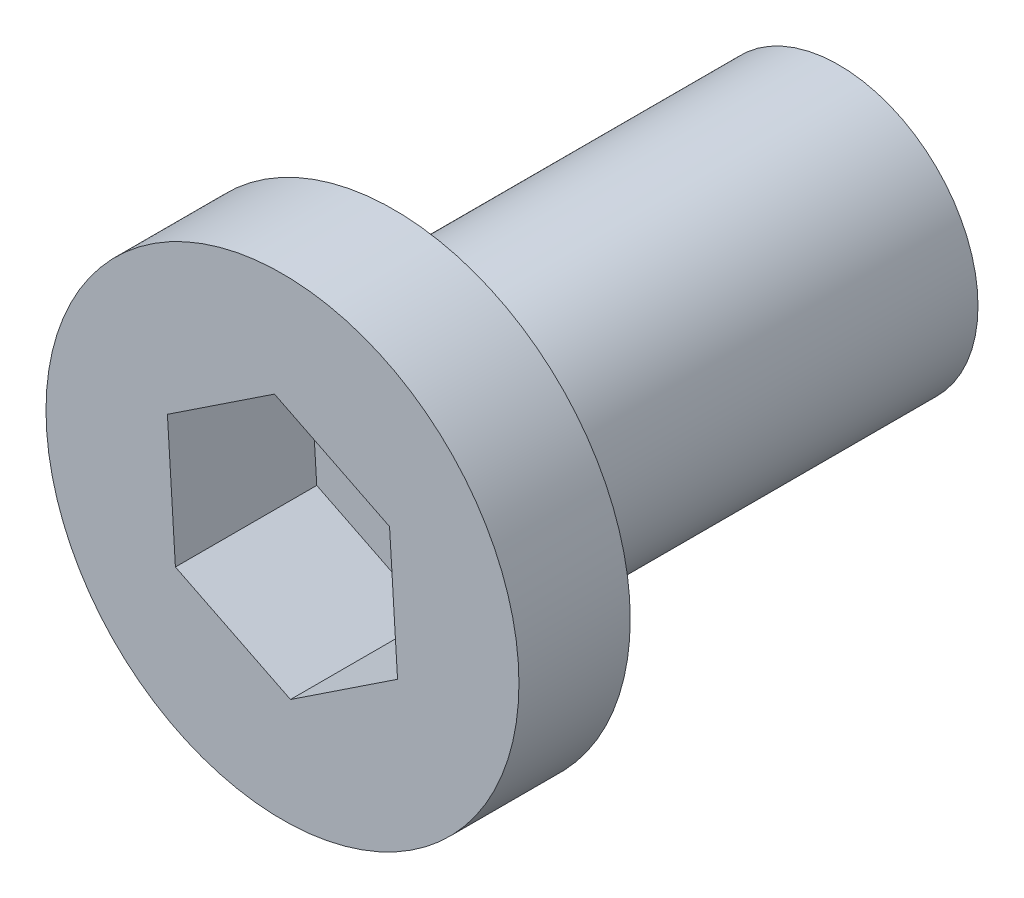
ISO-10303-21;
HEADER;
FILE_DESCRIPTION(('STEP AP214'),'2;1');
FILE_NAME('part.step','',(''),(''),'','','');
FILE_SCHEMA(('AUTOMOTIVE_DESIGN { 1 0 10303 214 1 1 1 1 }'));
ENDSEC;
DATA;
#1=APPLICATION_CONTEXT('core data for automotive mechanical design processes');
#2=APPLICATION_PROTOCOL_DEFINITION('international standard','automotive_design',2000,#1);
#3=PRODUCT_CONTEXT('',#1,'mechanical');
#4=PRODUCT('Part','Part','',(#3));
#5=PRODUCT_RELATED_PRODUCT_CATEGORY('part','',(#4));
#6=PRODUCT_DEFINITION_FORMATION('','',#4);
#7=PRODUCT_DEFINITION_CONTEXT('part definition',#1,'design');
#8=PRODUCT_DEFINITION('design','',#6,#7);
#9=PRODUCT_DEFINITION_SHAPE('','',#8);
#10=(LENGTH_UNIT() NAMED_UNIT(*) SI_UNIT(.MILLI.,.METRE.));
#11=(NAMED_UNIT(*) PLANE_ANGLE_UNIT() SI_UNIT($,.RADIAN.));
#12=(NAMED_UNIT(*) SI_UNIT($,.STERADIAN.) SOLID_ANGLE_UNIT());
#13=UNCERTAINTY_MEASURE_WITH_UNIT(LENGTH_MEASURE(1.E-05),#10,'distance_accuracy_value','');
#14=(GEOMETRIC_REPRESENTATION_CONTEXT(3) GLOBAL_UNCERTAINTY_ASSIGNED_CONTEXT((#13)) GLOBAL_UNIT_ASSIGNED_CONTEXT((#10,
#11,#12)) REPRESENTATION_CONTEXT('',''));
#15=CARTESIAN_POINT('',(0.,0.,0.));
#16=DIRECTION('',(0.,0.,1.));
#17=DIRECTION('',(1.,0.,0.));
#18=AXIS2_PLACEMENT_3D('',#15,#16,#17);
#19=CARTESIAN_POINT('',(0.,0.,8.));
#20=DIRECTION('',(0.,0.,-1.));
#21=DIRECTION('',(-1.,0.,0.));
#22=AXIS2_PLACEMENT_3D('',#19,#20,#21);
#23=CYLINDRICAL_SURFACE('',#22,2.5);
#24=CARTESIAN_POINT('',(0.,0.,8.));
#25=DIRECTION('',(0.,0.,1.));
#26=DIRECTION('',(1.,0.,0.));
#27=AXIS2_PLACEMENT_3D('',#24,#25,#26);
#28=CIRCLE('',#27,2.5);
#29=CARTESIAN_POINT('',(2.5,0.,8.));
#30=VERTEX_POINT('',#29);
#31=EDGE_CURVE('E11',#30,#30,#28,.T.);
#32=ORIENTED_EDGE('',*,*,#31,.F.);
#33=EDGE_LOOP('',(#32));
#34=FACE_BOUND('',#33,.T.);
#35=CARTESIAN_POINT('',(0.,0.,0.));
#36=DIRECTION('',(0.,0.,1.));
#37=DIRECTION('',(1.,0.,0.));
#38=AXIS2_PLACEMENT_3D('',#35,#36,#37);
#39=CIRCLE('',#38,2.5);
#40=CARTESIAN_POINT('',(2.5,0.,0.));
#41=VERTEX_POINT('',#40);
#42=EDGE_CURVE('E34',#41,#41,#39,.T.);
#43=ORIENTED_EDGE('',*,*,#42,.T.);
#44=EDGE_LOOP('',(#43));
#45=FACE_BOUND('',#44,.T.);
#46=ADVANCED_FACE('F31',(#34,#45),#23,.T.);
#47=CARTESIAN_POINT('',(0.,0.,0.));
#48=DIRECTION('',(0.,0.,1.));
#49=DIRECTION('',(1.,0.,0.));
#50=AXIS2_PLACEMENT_3D('',#47,#48,#49);
#51=PLANE('',#50);
#52=ORIENTED_EDGE('',*,*,#42,.F.);
#53=EDGE_LOOP('',(#52));
#54=FACE_BOUND('',#53,.T.);
#55=ADVANCED_FACE('F149',(#54),#51,.F.);
#56=CARTESIAN_POINT('',(0.,0.,8.));
#57=DIRECTION('',(0.,0.,1.));
#58=DIRECTION('',(1.,0.,0.));
#59=AXIS2_PLACEMENT_3D('',#56,#57,#58);
#60=PLANE('',#59);
#61=CARTESIAN_POINT('',(0.,0.,8.));
#62=DIRECTION('',(0.,0.,1.));
#63=DIRECTION('',(1.,0.,0.));
#64=AXIS2_PLACEMENT_3D('',#61,#62,#63);
#65=CIRCLE('',#64,4.25);
#66=CARTESIAN_POINT('',(4.25,0.,8.));
#67=VERTEX_POINT('',#66);
#68=EDGE_CURVE('E132',#67,#67,#65,.T.);
#69=ORIENTED_EDGE('',*,*,#68,.F.);
#70=EDGE_LOOP('',(#69));
#71=FACE_BOUND('',#70,.T.);
#72=ORIENTED_EDGE('',*,*,#31,.T.);
#73=EDGE_LOOP('',(#72));
#74=FACE_BOUND('',#73,.T.);
#75=ADVANCED_FACE('F146',(#71,#74),#60,.F.);
#76=CARTESIAN_POINT('',(0.,0.,10.));
#77=DIRECTION('',(0.,0.,-1.));
#78=DIRECTION('',(-1.,0.,0.));
#79=AXIS2_PLACEMENT_3D('',#76,#77,#78);
#80=CYLINDRICAL_SURFACE('',#79,4.25);
#81=CARTESIAN_POINT('',(0.,0.,10.));
#82=DIRECTION('',(0.,0.,1.));
#83=DIRECTION('',(1.,0.,0.));
#84=AXIS2_PLACEMENT_3D('',#81,#82,#83);
#85=CIRCLE('',#84,4.25);
#86=CARTESIAN_POINT('',(4.25,0.,10.));
#87=VERTEX_POINT('',#86);
#88=EDGE_CURVE('E138',#87,#87,#85,.T.);
#89=ORIENTED_EDGE('',*,*,#88,.F.);
#90=EDGE_LOOP('',(#89));
#91=FACE_BOUND('',#90,.T.);
#92=ORIENTED_EDGE('',*,*,#68,.T.);
#93=EDGE_LOOP('',(#92));
#94=FACE_BOUND('',#93,.T.);
#95=ADVANCED_FACE('F144',(#91,#94),#80,.T.);
#96=CARTESIAN_POINT('',(0.,0.,10.));
#97=DIRECTION('',(0.,0.,1.));
#98=DIRECTION('',(1.,0.,0.));
#99=AXIS2_PLACEMENT_3D('',#96,#97,#98);
#100=PLANE('',#99);
#101=DIRECTION('',(0.833193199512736,0.552981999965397,0.));
#102=VECTOR('',#101,1.);
#103=CARTESIAN_POINT('',(0.143875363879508,-2.30491501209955,10.));
#104=LINE('',#103,#102);
#105=CARTESIAN_POINT('',(0.143875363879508,-2.30491501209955,10.));
#106=VERTEX_POINT('',#105);
#107=CARTESIAN_POINT('',(2.06805263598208,-1.02785778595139,10.));
#108=VERTEX_POINT('',#107);
#109=EDGE_CURVE('E45',#106,#108,#104,.T.);
#110=ORIENTED_EDGE('',*,*,#109,.F.);
#111=DIRECTION('',(0.895493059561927,-0.445075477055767,0.));
#112=VECTOR('',#111,1.);
#113=CARTESIAN_POINT('',(-1.92417727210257,-1.27705722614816,10.));
#114=LINE('',#113,#112);
#115=CARTESIAN_POINT('',(-1.92417727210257,-1.27705722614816,10.));
#116=VERTEX_POINT('',#115);
#117=EDGE_CURVE('E128',#116,#106,#114,.T.);
#118=ORIENTED_EDGE('',*,*,#117,.F.);
#119=DIRECTION('',(0.062299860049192,-0.998057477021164,0.));
#120=VECTOR('',#119,1.);
#121=CARTESIAN_POINT('',(-2.06805263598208,1.02785778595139,10.));
#122=LINE('',#121,#120);
#123=CARTESIAN_POINT('',(-2.06805263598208,1.02785778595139,10.));
#124=VERTEX_POINT('',#123);
#125=EDGE_CURVE('E126',#124,#116,#122,.T.);
#126=ORIENTED_EDGE('',*,*,#125,.F.);
#127=DIRECTION('',(-0.833193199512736,-0.552981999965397,0.));
#128=VECTOR('',#127,1.);
#129=CARTESIAN_POINT('',(-0.143875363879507,2.30491501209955,10.));
#130=LINE('',#129,#128);
#131=CARTESIAN_POINT('',(-0.143875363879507,2.30491501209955,10.));
#132=VERTEX_POINT('',#131);
#133=EDGE_CURVE('E93',#132,#124,#130,.T.);
#134=ORIENTED_EDGE('',*,*,#133,.F.);
#135=DIRECTION('',(-0.895493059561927,0.445075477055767,0.));
#136=VECTOR('',#135,1.);
#137=CARTESIAN_POINT('',(1.92417727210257,1.27705722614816,10.));
#138=LINE('',#137,#136);
#139=CARTESIAN_POINT('',(1.92417727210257,1.27705722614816,10.));
#140=VERTEX_POINT('',#139);
#141=EDGE_CURVE('E122',#140,#132,#138,.T.);
#142=ORIENTED_EDGE('',*,*,#141,.F.);
#143=DIRECTION('',(-0.0622998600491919,0.998057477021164,0.));
#144=VECTOR('',#143,1.);
#145=CARTESIAN_POINT('',(2.06805263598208,-1.02785778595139,10.));
#146=LINE('',#145,#144);
#147=EDGE_CURVE('E119',#108,#140,#146,.T.);
#148=ORIENTED_EDGE('',*,*,#147,.F.);
#149=EDGE_LOOP('',(#110,#118,#126,#134,#142,#148));
#150=FACE_BOUND('',#149,.T.);
#151=ORIENTED_EDGE('',*,*,#88,.T.);
#152=EDGE_LOOP('',(#151));
#153=FACE_BOUND('',#152,.T.);
#154=ADVANCED_FACE('F163',(#150,#153),#100,.T.);
#155=CARTESIAN_POINT('',(0.143875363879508,-2.30491501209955,7.46));
#156=DIRECTION('',(0.552981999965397,-0.833193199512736,0.));
#157=DIRECTION('',(0.833193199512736,0.552981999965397,0.));
#158=AXIS2_PLACEMENT_3D('',#155,#156,#157);
#159=PLANE('',#158);
#160=ORIENTED_EDGE('',*,*,#109,.T.);
#161=DIRECTION('',(0.,0.,1.));
#162=VECTOR('',#161,1.);
#163=CARTESIAN_POINT('',(2.06805263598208,-1.02785778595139,7.46));
#164=LINE('',#163,#162);
#165=CARTESIAN_POINT('',(2.06805263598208,-1.02785778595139,7.46));
#166=VERTEX_POINT('',#165);
#167=EDGE_CURVE('E75',#166,#108,#164,.T.);
#168=ORIENTED_EDGE('',*,*,#167,.F.);
#169=DIRECTION('',(0.833193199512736,0.552981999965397,0.));
#170=VECTOR('',#169,1.);
#171=CARTESIAN_POINT('',(0.143875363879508,-2.30491501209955,7.46));
#172=LINE('',#171,#170);
#173=CARTESIAN_POINT('',(0.143875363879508,-2.30491501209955,7.46));
#174=VERTEX_POINT('',#173);
#175=EDGE_CURVE('E130',#174,#166,#172,.T.);
#176=ORIENTED_EDGE('',*,*,#175,.F.);
#177=DIRECTION('',(0.,0.,1.));
#178=VECTOR('',#177,1.);
#179=CARTESIAN_POINT('',(0.143875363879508,-2.30491501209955,7.46));
#180=LINE('',#179,#178);
#181=EDGE_CURVE('E53',#174,#106,#180,.T.);
#182=ORIENTED_EDGE('',*,*,#181,.T.);
#183=EDGE_LOOP('',(#160,#168,#176,#182));
#184=FACE_BOUND('',#183,.T.);
#185=ADVANCED_FACE('F168',(#184),#159,.F.);
#186=CARTESIAN_POINT('',(-1.92417727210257,-1.27705722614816,7.46));
#187=DIRECTION('',(-0.445075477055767,-0.895493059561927,0.));
#188=DIRECTION('',(0.895493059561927,-0.445075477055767,0.));
#189=AXIS2_PLACEMENT_3D('',#186,#187,#188);
#190=PLANE('',#189);
#191=ORIENTED_EDGE('',*,*,#117,.T.);
#192=ORIENTED_EDGE('',*,*,#181,.F.);
#193=DIRECTION('',(0.895493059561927,-0.445075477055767,0.));
#194=VECTOR('',#193,1.);
#195=CARTESIAN_POINT('',(-1.92417727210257,-1.27705722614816,7.46));
#196=LINE('',#195,#194);
#197=CARTESIAN_POINT('',(-1.92417727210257,-1.27705722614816,7.46));
#198=VERTEX_POINT('',#197);
#199=EDGE_CURVE('E105',#198,#174,#196,.T.);
#200=ORIENTED_EDGE('',*,*,#199,.F.);
#201=DIRECTION('',(0.,0.,1.));
#202=VECTOR('',#201,1.);
#203=CARTESIAN_POINT('',(-1.92417727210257,-1.27705722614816,7.46));
#204=LINE('',#203,#202);
#205=EDGE_CURVE('E97',#198,#116,#204,.T.);
#206=ORIENTED_EDGE('',*,*,#205,.T.);
#207=EDGE_LOOP('',(#191,#192,#200,#206));
#208=FACE_BOUND('',#207,.T.);
#209=ADVANCED_FACE('F172',(#208),#190,.F.);
#210=CARTESIAN_POINT('',(-2.06805263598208,1.02785778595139,7.46));
#211=DIRECTION('',(-0.998057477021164,-0.062299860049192,0.));
#212=DIRECTION('',(0.062299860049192,-0.998057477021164,0.));
#213=AXIS2_PLACEMENT_3D('',#210,#211,#212);
#214=PLANE('',#213);
#215=ORIENTED_EDGE('',*,*,#125,.T.);
#216=ORIENTED_EDGE('',*,*,#205,.F.);
#217=DIRECTION('',(0.062299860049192,-0.998057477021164,0.));
#218=VECTOR('',#217,1.);
#219=CARTESIAN_POINT('',(-2.06805263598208,1.02785778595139,7.46));
#220=LINE('',#219,#218);
#221=CARTESIAN_POINT('',(-2.06805263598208,1.02785778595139,7.46));
#222=VERTEX_POINT('',#221);
#223=EDGE_CURVE('E101',#222,#198,#220,.T.);
#224=ORIENTED_EDGE('',*,*,#223,.F.);
#225=DIRECTION('',(0.,0.,1.));
#226=VECTOR('',#225,1.);
#227=CARTESIAN_POINT('',(-2.06805263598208,1.02785778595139,7.46));
#228=LINE('',#227,#226);
#229=EDGE_CURVE('E86',#222,#124,#228,.T.);
#230=ORIENTED_EDGE('',*,*,#229,.T.);
#231=EDGE_LOOP('',(#215,#216,#224,#230));
#232=FACE_BOUND('',#231,.T.);
#233=ADVANCED_FACE('F102',(#232),#214,.F.);
#234=CARTESIAN_POINT('',(-0.143875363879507,2.30491501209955,7.46));
#235=DIRECTION('',(-0.552981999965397,0.833193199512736,0.));
#236=DIRECTION('',(-0.833193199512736,-0.552981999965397,0.));
#237=AXIS2_PLACEMENT_3D('',#234,#235,#236);
#238=PLANE('',#237);
#239=ORIENTED_EDGE('',*,*,#133,.T.);
#240=ORIENTED_EDGE('',*,*,#229,.F.);
#241=DIRECTION('',(-0.833193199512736,-0.552981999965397,0.));
#242=VECTOR('',#241,1.);
#243=CARTESIAN_POINT('',(-0.143875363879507,2.30491501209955,7.46));
#244=LINE('',#243,#242);
#245=CARTESIAN_POINT('',(-0.143875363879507,2.30491501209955,7.46));
#246=VERTEX_POINT('',#245);
#247=EDGE_CURVE('E90',#246,#222,#244,.T.);
#248=ORIENTED_EDGE('',*,*,#247,.F.);
#249=DIRECTION('',(0.,0.,1.));
#250=VECTOR('',#249,1.);
#251=CARTESIAN_POINT('',(-0.143875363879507,2.30491501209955,7.46));
#252=LINE('',#251,#250);
#253=EDGE_CURVE('E98',#246,#132,#252,.T.);
#254=ORIENTED_EDGE('',*,*,#253,.T.);
#255=EDGE_LOOP('',(#239,#240,#248,#254));
#256=FACE_BOUND('',#255,.T.);
#257=ADVANCED_FACE('F88',(#256),#238,.F.);
#258=CARTESIAN_POINT('',(1.92417727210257,1.27705722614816,7.46));
#259=DIRECTION('',(0.445075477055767,0.895493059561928,0.));
#260=DIRECTION('',(-0.895493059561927,0.445075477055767,0.));
#261=AXIS2_PLACEMENT_3D('',#258,#259,#260);
#262=PLANE('',#261);
#263=ORIENTED_EDGE('',*,*,#141,.T.);
#264=ORIENTED_EDGE('',*,*,#253,.F.);
#265=DIRECTION('',(-0.895493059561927,0.445075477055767,0.));
#266=VECTOR('',#265,1.);
#267=CARTESIAN_POINT('',(1.92417727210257,1.27705722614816,7.46));
#268=LINE('',#267,#266);
#269=CARTESIAN_POINT('',(1.92417727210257,1.27705722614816,7.46));
#270=VERTEX_POINT('',#269);
#271=EDGE_CURVE('E111',#270,#246,#268,.T.);
#272=ORIENTED_EDGE('',*,*,#271,.F.);
#273=DIRECTION('',(0.,0.,1.));
#274=VECTOR('',#273,1.);
#275=CARTESIAN_POINT('',(1.92417727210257,1.27705722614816,7.46));
#276=LINE('',#275,#274);
#277=EDGE_CURVE('E135',#270,#140,#276,.T.);
#278=ORIENTED_EDGE('',*,*,#277,.T.);
#279=EDGE_LOOP('',(#263,#264,#272,#278));
#280=FACE_BOUND('',#279,.T.);
#281=ADVANCED_FACE('F176',(#280),#262,.F.);
#282=CARTESIAN_POINT('',(2.06805263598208,-1.02785778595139,7.46));
#283=DIRECTION('',(0.998057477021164,0.0622998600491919,0.));
#284=DIRECTION('',(-0.0622998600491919,0.998057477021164,0.));
#285=AXIS2_PLACEMENT_3D('',#282,#283,#284);
#286=PLANE('',#285);
#287=ORIENTED_EDGE('',*,*,#147,.T.);
#288=ORIENTED_EDGE('',*,*,#277,.F.);
#289=DIRECTION('',(-0.0622998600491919,0.998057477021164,0.));
#290=VECTOR('',#289,1.);
#291=CARTESIAN_POINT('',(2.06805263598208,-1.02785778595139,7.46));
#292=LINE('',#291,#290);
#293=EDGE_CURVE('E113',#166,#270,#292,.T.);
#294=ORIENTED_EDGE('',*,*,#293,.F.);
#295=ORIENTED_EDGE('',*,*,#167,.T.);
#296=EDGE_LOOP('',(#287,#288,#294,#295));
#297=FACE_BOUND('',#296,.T.);
#298=ADVANCED_FACE('F173',(#297),#286,.F.);
#299=CARTESIAN_POINT('',(2.06805263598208,-1.02785778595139,7.46));
#300=DIRECTION('',(0.,0.,1.));
#301=DIRECTION('',(1.,0.,0.));
#302=AXIS2_PLACEMENT_3D('',#299,#300,#301);
#303=PLANE('',#302);
#304=ORIENTED_EDGE('',*,*,#175,.T.);
#305=ORIENTED_EDGE('',*,*,#293,.T.);
#306=ORIENTED_EDGE('',*,*,#271,.T.);
#307=ORIENTED_EDGE('',*,*,#247,.T.);
#308=ORIENTED_EDGE('',*,*,#223,.T.);
#309=ORIENTED_EDGE('',*,*,#199,.T.);
#310=EDGE_LOOP('',(#304,#305,#306,#307,#308,#309));
#311=FACE_BOUND('',#310,.T.);
#312=ADVANCED_FACE('F108',(#311),#303,.T.);
#313=CLOSED_SHELL('',(#46,#55,#75,#95,#154,#185,#209,#233,#257,#281,#298,#312));
#314=MANIFOLD_SOLID_BREP('B2',#313);
#315=ADVANCED_BREP_SHAPE_REPRESENTATION('',(#18,#314),#14);
#316=SHAPE_DEFINITION_REPRESENTATION(#9,#315);
ENDSEC;
END-ISO-10303-21;
